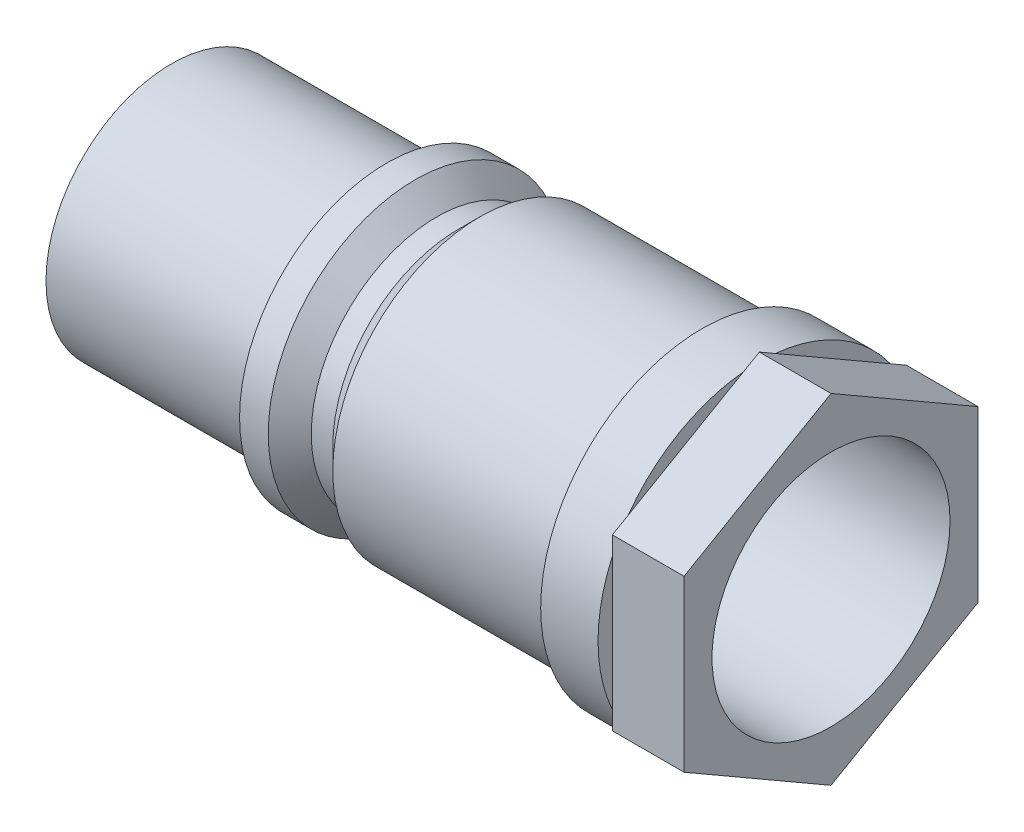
ISO-10303-21;
HEADER;
FILE_DESCRIPTION(('STEP AP214'),'2;1');
FILE_NAME('part.step','',(''),(''),'','','');
FILE_SCHEMA(('AUTOMOTIVE_DESIGN { 1 0 10303 214 1 1 1 1 }'));
ENDSEC;
DATA;
#1=APPLICATION_CONTEXT('core data for automotive mechanical design processes');
#2=APPLICATION_PROTOCOL_DEFINITION('international standard','automotive_design',2000,#1);
#3=PRODUCT_CONTEXT('',#1,'mechanical');
#4=PRODUCT('Part','Part','',(#3));
#5=PRODUCT_RELATED_PRODUCT_CATEGORY('part','',(#4));
#6=PRODUCT_DEFINITION_FORMATION('','',#4);
#7=PRODUCT_DEFINITION_CONTEXT('part definition',#1,'design');
#8=PRODUCT_DEFINITION('design','',#6,#7);
#9=PRODUCT_DEFINITION_SHAPE('','',#8);
#10=(LENGTH_UNIT() NAMED_UNIT(*) SI_UNIT(.MILLI.,.METRE.));
#11=(NAMED_UNIT(*) PLANE_ANGLE_UNIT() SI_UNIT($,.RADIAN.));
#12=(NAMED_UNIT(*) SI_UNIT($,.STERADIAN.) SOLID_ANGLE_UNIT());
#13=UNCERTAINTY_MEASURE_WITH_UNIT(LENGTH_MEASURE(1.E-05),#10,'distance_accuracy_value','');
#14=(GEOMETRIC_REPRESENTATION_CONTEXT(3) GLOBAL_UNCERTAINTY_ASSIGNED_CONTEXT((#13)) GLOBAL_UNIT_ASSIGNED_CONTEXT((#10,
#11,#12)) REPRESENTATION_CONTEXT('',''));
#15=CARTESIAN_POINT('',(0.,0.,0.));
#16=DIRECTION('',(0.,0.,1.));
#17=DIRECTION('',(1.,0.,0.));
#18=AXIS2_PLACEMENT_3D('',#15,#16,#17);
#19=CARTESIAN_POINT('',(82.,22.5,0.));
#20=DIRECTION('',(-1.,0.,0.));
#21=DIRECTION('',(0.,0.,1.));
#22=AXIS2_PLACEMENT_3D('',#19,#20,#21);
#23=PLANE('',#22);
#24=DIRECTION('',(0.,0.5,0.866025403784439));
#25=VECTOR('',#24,1.);
#26=CARTESIAN_POINT('',(82.,11.8356805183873,-20.5));
#27=LINE('',#26,#25);
#28=CARTESIAN_POINT('',(82.,13.1167115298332,-18.2811892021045));
#29=VERTEX_POINT('',#28);
#30=CARTESIAN_POINT('',(82.,22.3903300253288,-2.21881079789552));
#31=VERTEX_POINT('',#30);
#32=EDGE_CURVE('E11',#29,#31,#27,.T.);
#33=ORIENTED_EDGE('',*,*,#32,.F.);
#34=CARTESIAN_POINT('',(82.,0.,0.));
#35=DIRECTION('',(-1.,0.,0.));
#36=DIRECTION('',(0.,0.,1.));
#37=AXIS2_PLACEMENT_3D('',#34,#35,#36);
#38=CIRCLE('',#37,22.5);
#39=EDGE_CURVE('E269',#31,#29,#38,.T.);
#40=ORIENTED_EDGE('',*,*,#39,.F.);
#41=EDGE_LOOP('',(#33,#40));
#42=FACE_BOUND('',#41,.T.);
#43=ADVANCED_FACE('F33',(#42),#23,.F.);
#44=DIRECTION('',(0.,1.,0.));
#45=VECTOR('',#44,1.);
#46=CARTESIAN_POINT('',(82.,-11.8356805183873,-20.5));
#47=LINE('',#46,#45);
#48=CARTESIAN_POINT('',(82.,-9.2736184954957,-20.5));
#49=VERTEX_POINT('',#48);
#50=CARTESIAN_POINT('',(82.,9.27361849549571,-20.5));
#51=VERTEX_POINT('',#50);
#52=EDGE_CURVE('E42',#49,#51,#47,.T.);
#53=ORIENTED_EDGE('',*,*,#52,.F.);
#54=EDGE_CURVE('E273',#51,#49,#38,.T.);
#55=ORIENTED_EDGE('',*,*,#54,.F.);
#56=EDGE_LOOP('',(#53,#55));
#57=FACE_BOUND('',#56,.T.);
#58=ADVANCED_FACE('F238',(#57),#23,.F.);
#59=DIRECTION('',(0.,0.5,-0.866025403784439));
#60=VECTOR('',#59,1.);
#61=CARTESIAN_POINT('',(82.,-23.6713610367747,0.));
#62=LINE('',#61,#60);
#63=CARTESIAN_POINT('',(82.,-22.3903300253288,-2.21881079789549));
#64=VERTEX_POINT('',#63);
#65=CARTESIAN_POINT('',(82.,-13.1167115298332,-18.2811892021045));
#66=VERTEX_POINT('',#65);
#67=EDGE_CURVE('E307',#64,#66,#62,.T.);
#68=ORIENTED_EDGE('',*,*,#67,.F.);
#69=EDGE_CURVE('E279',#66,#64,#38,.T.);
#70=ORIENTED_EDGE('',*,*,#69,.F.);
#71=EDGE_LOOP('',(#68,#70));
#72=FACE_BOUND('',#71,.T.);
#73=ADVANCED_FACE('F245',(#72),#23,.F.);
#74=DIRECTION('',(0.,-0.5,-0.866025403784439));
#75=VECTOR('',#74,1.);
#76=CARTESIAN_POINT('',(82.,-11.8356805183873,20.5));
#77=LINE('',#76,#75);
#78=CARTESIAN_POINT('',(82.,-13.1167115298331,18.2811892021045));
#79=VERTEX_POINT('',#78);
#80=CARTESIAN_POINT('',(82.,-22.3903300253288,2.21881079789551));
#81=VERTEX_POINT('',#80);
#82=EDGE_CURVE('E58',#79,#81,#77,.T.);
#83=ORIENTED_EDGE('',*,*,#82,.F.);
#84=EDGE_CURVE('E285',#81,#79,#38,.T.);
#85=ORIENTED_EDGE('',*,*,#84,.F.);
#86=EDGE_LOOP('',(#83,#85));
#87=FACE_BOUND('',#86,.T.);
#88=ADVANCED_FACE('F257',(#87),#23,.F.);
#89=DIRECTION('',(0.,-1.,0.));
#90=VECTOR('',#89,1.);
#91=CARTESIAN_POINT('',(82.,11.8356805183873,20.5));
#92=LINE('',#91,#90);
#93=CARTESIAN_POINT('',(82.,9.27361849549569,20.5));
#94=VERTEX_POINT('',#93);
#95=CARTESIAN_POINT('',(82.,-9.27361849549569,20.5));
#96=VERTEX_POINT('',#95);
#97=EDGE_CURVE('E190',#94,#96,#92,.T.);
#98=ORIENTED_EDGE('',*,*,#97,.F.);
#99=EDGE_CURVE('E51',#96,#94,#38,.T.);
#100=ORIENTED_EDGE('',*,*,#99,.F.);
#101=EDGE_LOOP('',(#98,#100));
#102=FACE_BOUND('',#101,.T.);
#103=ADVANCED_FACE('F250',(#102),#23,.F.);
#104=DIRECTION('',(0.,-0.5,0.866025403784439));
#105=VECTOR('',#104,1.);
#106=CARTESIAN_POINT('',(82.,23.6713610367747,0.));
#107=LINE('',#106,#105);
#108=CARTESIAN_POINT('',(82.,22.3903300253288,2.21881079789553));
#109=VERTEX_POINT('',#108);
#110=CARTESIAN_POINT('',(82.,13.1167115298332,18.2811892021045));
#111=VERTEX_POINT('',#110);
#112=EDGE_CURVE('E186',#109,#111,#107,.T.);
#113=ORIENTED_EDGE('',*,*,#112,.F.);
#114=EDGE_CURVE('E161',#111,#109,#38,.T.);
#115=ORIENTED_EDGE('',*,*,#114,.F.);
#116=EDGE_LOOP('',(#113,#115));
#117=FACE_BOUND('',#116,.T.);
#118=ADVANCED_FACE('F241',(#117),#23,.F.);
#119=CARTESIAN_POINT('',(0.,0.,0.));
#120=DIRECTION('',(1.,0.,0.));
#121=DIRECTION('',(0.,0.,-1.));
#122=AXIS2_PLACEMENT_3D('',#119,#120,#121);
#123=PLANE('',#122);
#124=CARTESIAN_POINT('',(0.,0.,0.));
#125=DIRECTION('',(1.,0.,0.));
#126=DIRECTION('',(0.,0.,-1.));
#127=AXIS2_PLACEMENT_3D('',#124,#125,#126);
#128=CIRCLE('',#127,16.6);
#129=CARTESIAN_POINT('',(0.,0.,-16.6));
#130=VERTEX_POINT('',#129);
#131=EDGE_CURVE('E200',#130,#130,#128,.T.);
#132=ORIENTED_EDGE('',*,*,#131,.T.);
#133=EDGE_LOOP('',(#132));
#134=FACE_BOUND('',#133,.T.);
#135=CARTESIAN_POINT('',(0.,0.,0.));
#136=DIRECTION('',(-1.,0.,0.));
#137=DIRECTION('',(0.,0.,1.));
#138=AXIS2_PLACEMENT_3D('',#135,#136,#137);
#139=CIRCLE('',#138,17.5);
#140=CARTESIAN_POINT('',(0.,0.,17.5));
#141=VERTEX_POINT('',#140);
#142=EDGE_CURVE('E37',#141,#141,#139,.T.);
#143=ORIENTED_EDGE('',*,*,#142,.T.);
#144=EDGE_LOOP('',(#143));
#145=FACE_BOUND('',#144,.T.);
#146=ADVANCED_FACE('F35',(#134,#145),#123,.F.);
#147=CARTESIAN_POINT('',(0.,0.,0.));
#148=DIRECTION('',(-1.,0.,0.));
#149=DIRECTION('',(0.,0.,1.));
#150=AXIS2_PLACEMENT_3D('',#147,#148,#149);
#151=CYLINDRICAL_SURFACE('',#150,17.5);
#152=ORIENTED_EDGE('',*,*,#142,.F.);
#153=EDGE_LOOP('',(#152));
#154=FACE_BOUND('',#153,.T.);
#155=CARTESIAN_POINT('',(30.,0.,0.));
#156=DIRECTION('',(-1.,0.,0.));
#157=DIRECTION('',(0.,0.,1.));
#158=AXIS2_PLACEMENT_3D('',#155,#156,#157);
#159=CIRCLE('',#158,17.5);
#160=CARTESIAN_POINT('',(30.,0.,17.5));
#161=VERTEX_POINT('',#160);
#162=EDGE_CURVE('E181',#161,#161,#159,.T.);
#163=ORIENTED_EDGE('',*,*,#162,.T.);
#164=EDGE_LOOP('',(#163));
#165=FACE_BOUND('',#164,.T.);
#166=ADVANCED_FACE('F256',(#154,#165),#151,.T.);
#167=CARTESIAN_POINT('',(30.,17.5,0.));
#168=DIRECTION('',(1.,0.,0.));
#169=DIRECTION('',(0.,0.,-1.));
#170=AXIS2_PLACEMENT_3D('',#167,#168,#169);
#171=PLANE('',#170);
#172=ORIENTED_EDGE('',*,*,#162,.F.);
#173=EDGE_LOOP('',(#172));
#174=FACE_BOUND('',#173,.T.);
#175=CARTESIAN_POINT('',(30.,0.,0.));
#176=DIRECTION('',(-1.,0.,0.));
#177=DIRECTION('',(0.,0.,1.));
#178=AXIS2_PLACEMENT_3D('',#175,#176,#177);
#179=CIRCLE('',#178,20.5);
#180=CARTESIAN_POINT('',(30.,0.,20.5));
#181=VERTEX_POINT('',#180);
#182=EDGE_CURVE('E179',#181,#181,#179,.T.);
#183=ORIENTED_EDGE('',*,*,#182,.T.);
#184=EDGE_LOOP('',(#183));
#185=FACE_BOUND('',#184,.T.);
#186=ADVANCED_FACE('F470',(#174,#185),#171,.F.);
#187=CARTESIAN_POINT('',(0.,0.,0.));
#188=DIRECTION('',(-1.,0.,0.));
#189=DIRECTION('',(0.,0.,1.));
#190=AXIS2_PLACEMENT_3D('',#187,#188,#189);
#191=CYLINDRICAL_SURFACE('',#190,20.5);
#192=ORIENTED_EDGE('',*,*,#182,.F.);
#193=EDGE_LOOP('',(#192));
#194=FACE_BOUND('',#193,.T.);
#195=CARTESIAN_POINT('',(34.,0.,0.));
#196=DIRECTION('',(-1.,0.,0.));
#197=DIRECTION('',(0.,0.,1.));
#198=AXIS2_PLACEMENT_3D('',#195,#196,#197);
#199=CIRCLE('',#198,20.5);
#200=CARTESIAN_POINT('',(34.,0.,20.5));
#201=VERTEX_POINT('',#200);
#202=EDGE_CURVE('E176',#201,#201,#199,.T.);
#203=ORIENTED_EDGE('',*,*,#202,.T.);
#204=EDGE_LOOP('',(#203));
#205=FACE_BOUND('',#204,.T.);
#206=ADVANCED_FACE('F476',(#194,#205),#191,.T.);
#207=CARTESIAN_POINT('',(37.,0.,0.));
#208=DIRECTION('',(-1.,0.,0.));
#209=DIRECTION('',(0.,0.,1.));
#210=AXIS2_PLACEMENT_3D('',#207,#208,#209);
#211=CONICAL_SURFACE('',#210,17.5,0.78539816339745);
#212=ORIENTED_EDGE('',*,*,#202,.F.);
#213=EDGE_LOOP('',(#212));
#214=FACE_BOUND('',#213,.T.);
#215=CARTESIAN_POINT('',(37.,0.,0.));
#216=DIRECTION('',(-1.,0.,0.));
#217=DIRECTION('',(0.,0.,1.));
#218=AXIS2_PLACEMENT_3D('',#215,#216,#217);
#219=CIRCLE('',#218,17.5);
#220=CARTESIAN_POINT('',(37.,0.,17.5));
#221=VERTEX_POINT('',#220);
#222=EDGE_CURVE('E173',#221,#221,#219,.T.);
#223=ORIENTED_EDGE('',*,*,#222,.T.);
#224=EDGE_LOOP('',(#223));
#225=FACE_BOUND('',#224,.T.);
#226=ADVANCED_FACE('F484',(#214,#225),#211,.T.);
#227=CARTESIAN_POINT('',(0.,0.,0.));
#228=DIRECTION('',(-1.,0.,0.));
#229=DIRECTION('',(0.,0.,1.));
#230=AXIS2_PLACEMENT_3D('',#227,#228,#229);
#231=CYLINDRICAL_SURFACE('',#230,17.5);
#232=ORIENTED_EDGE('',*,*,#222,.F.);
#233=EDGE_LOOP('',(#232));
#234=FACE_BOUND('',#233,.T.);
#235=CARTESIAN_POINT('',(40.,0.,0.));
#236=DIRECTION('',(-1.,0.,0.));
#237=DIRECTION('',(0.,0.,1.));
#238=AXIS2_PLACEMENT_3D('',#235,#236,#237);
#239=CIRCLE('',#238,17.5);
#240=CARTESIAN_POINT('',(40.,0.,17.5));
#241=VERTEX_POINT('',#240);
#242=EDGE_CURVE('E170',#241,#241,#239,.T.);
#243=ORIENTED_EDGE('',*,*,#242,.T.);
#244=EDGE_LOOP('',(#243));
#245=FACE_BOUND('',#244,.T.);
#246=ADVANCED_FACE('F492',(#234,#245),#231,.T.);
#247=CARTESIAN_POINT('',(43.,0.,0.));
#248=DIRECTION('',(1.,0.,0.));
#249=DIRECTION('',(0.,0.,-1.));
#250=AXIS2_PLACEMENT_3D('',#247,#248,#249);
#251=CONICAL_SURFACE('',#250,20.5,0.785398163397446);
#252=ORIENTED_EDGE('',*,*,#242,.F.);
#253=EDGE_LOOP('',(#252));
#254=FACE_BOUND('',#253,.T.);
#255=CARTESIAN_POINT('',(43.,0.,0.));
#256=DIRECTION('',(-1.,0.,0.));
#257=DIRECTION('',(0.,0.,1.));
#258=AXIS2_PLACEMENT_3D('',#255,#256,#257);
#259=CIRCLE('',#258,20.5);
#260=CARTESIAN_POINT('',(43.,0.,20.5));
#261=VERTEX_POINT('',#260);
#262=EDGE_CURVE('E167',#261,#261,#259,.T.);
#263=ORIENTED_EDGE('',*,*,#262,.T.);
#264=EDGE_LOOP('',(#263));
#265=FACE_BOUND('',#264,.T.);
#266=ADVANCED_FACE('F500',(#254,#265),#251,.T.);
#267=CARTESIAN_POINT('',(0.,0.,0.));
#268=DIRECTION('',(-1.,0.,0.));
#269=DIRECTION('',(0.,0.,1.));
#270=AXIS2_PLACEMENT_3D('',#267,#268,#269);
#271=CYLINDRICAL_SURFACE('',#270,20.5);
#272=ORIENTED_EDGE('',*,*,#262,.F.);
#273=EDGE_LOOP('',(#272));
#274=FACE_BOUND('',#273,.T.);
#275=CARTESIAN_POINT('',(74.,0.,0.));
#276=DIRECTION('',(-1.,0.,0.));
#277=DIRECTION('',(0.,0.,1.));
#278=AXIS2_PLACEMENT_3D('',#275,#276,#277);
#279=CIRCLE('',#278,20.5);
#280=CARTESIAN_POINT('',(74.,0.,20.5));
#281=VERTEX_POINT('',#280);
#282=EDGE_CURVE('E164',#281,#281,#279,.T.);
#283=ORIENTED_EDGE('',*,*,#282,.T.);
#284=EDGE_LOOP('',(#283));
#285=FACE_BOUND('',#284,.T.);
#286=ADVANCED_FACE('F508',(#274,#285),#271,.T.);
#287=CARTESIAN_POINT('',(74.,20.5,0.));
#288=DIRECTION('',(1.,0.,0.));
#289=DIRECTION('',(0.,0.,-1.));
#290=AXIS2_PLACEMENT_3D('',#287,#288,#289);
#291=PLANE('',#290);
#292=ORIENTED_EDGE('',*,*,#282,.F.);
#293=EDGE_LOOP('',(#292));
#294=FACE_BOUND('',#293,.T.);
#295=CARTESIAN_POINT('',(74.,0.,0.));
#296=DIRECTION('',(-1.,0.,0.));
#297=DIRECTION('',(0.,0.,1.));
#298=AXIS2_PLACEMENT_3D('',#295,#296,#297);
#299=CIRCLE('',#298,22.5);
#300=CARTESIAN_POINT('',(74.,0.,22.5));
#301=VERTEX_POINT('',#300);
#302=EDGE_CURVE('E160',#301,#301,#299,.T.);
#303=ORIENTED_EDGE('',*,*,#302,.T.);
#304=EDGE_LOOP('',(#303));
#305=FACE_BOUND('',#304,.T.);
#306=ADVANCED_FACE('F353',(#294,#305),#291,.F.);
#307=CARTESIAN_POINT('',(0.,0.,0.));
#308=DIRECTION('',(-1.,0.,0.));
#309=DIRECTION('',(0.,0.,1.));
#310=AXIS2_PLACEMENT_3D('',#307,#308,#309);
#311=CYLINDRICAL_SURFACE('',#310,22.5);
#312=ORIENTED_EDGE('',*,*,#302,.F.);
#313=EDGE_LOOP('',(#312));
#314=FACE_BOUND('',#313,.T.);
#315=EDGE_CURVE('E155',#94,#111,#38,.T.);
#316=ORIENTED_EDGE('',*,*,#315,.T.);
#317=ORIENTED_EDGE('',*,*,#114,.T.);
#318=EDGE_CURVE('E265',#109,#31,#38,.T.);
#319=ORIENTED_EDGE('',*,*,#318,.T.);
#320=ORIENTED_EDGE('',*,*,#39,.T.);
#321=EDGE_CURVE('E270',#29,#51,#38,.T.);
#322=ORIENTED_EDGE('',*,*,#321,.T.);
#323=ORIENTED_EDGE('',*,*,#54,.T.);
#324=EDGE_CURVE('E276',#49,#66,#38,.T.);
#325=ORIENTED_EDGE('',*,*,#324,.T.);
#326=ORIENTED_EDGE('',*,*,#69,.T.);
#327=EDGE_CURVE('E282',#64,#81,#38,.T.);
#328=ORIENTED_EDGE('',*,*,#327,.T.);
#329=ORIENTED_EDGE('',*,*,#84,.T.);
#330=EDGE_CURVE('E153',#79,#96,#38,.T.);
#331=ORIENTED_EDGE('',*,*,#330,.T.);
#332=ORIENTED_EDGE('',*,*,#99,.T.);
#333=EDGE_LOOP('',(#316,#317,#319,#320,#322,#323,#325,#326,#328,#329,#331,#332));
#334=FACE_BOUND('',#333,.T.);
#335=ADVANCED_FACE('F263',(#314,#334),#311,.T.);
#336=CARTESIAN_POINT('',(82.,0.,0.));
#337=DIRECTION('',(1.,0.,0.));
#338=DIRECTION('',(0.,0.,-1.));
#339=AXIS2_PLACEMENT_3D('',#336,#337,#338);
#340=PLANE('',#339);
#341=ORIENTED_EDGE('',*,*,#315,.F.);
#342=CARTESIAN_POINT('',(82.,11.8356805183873,20.5));
#343=VERTEX_POINT('',#342);
#344=EDGE_CURVE('E196',#343,#94,#92,.T.);
#345=ORIENTED_EDGE('',*,*,#344,.F.);
#346=EDGE_CURVE('E193',#111,#343,#107,.T.);
#347=ORIENTED_EDGE('',*,*,#346,.F.);
#348=EDGE_LOOP('',(#341,#345,#347));
#349=FACE_BOUND('',#348,.T.);
#350=ADVANCED_FACE('F232',(#349),#340,.F.);
#351=ORIENTED_EDGE('',*,*,#318,.F.);
#352=CARTESIAN_POINT('',(82.,23.6713610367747,0.));
#353=VERTEX_POINT('',#352);
#354=EDGE_CURVE('E192',#353,#109,#107,.T.);
#355=ORIENTED_EDGE('',*,*,#354,.F.);
#356=EDGE_CURVE('E45',#31,#353,#27,.T.);
#357=ORIENTED_EDGE('',*,*,#356,.F.);
#358=EDGE_LOOP('',(#351,#355,#357));
#359=FACE_BOUND('',#358,.T.);
#360=ADVANCED_FACE('F268',(#359),#340,.F.);
#361=ORIENTED_EDGE('',*,*,#321,.F.);
#362=CARTESIAN_POINT('',(82.,11.8356805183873,-20.5));
#363=VERTEX_POINT('',#362);
#364=EDGE_CURVE('E44',#363,#29,#27,.T.);
#365=ORIENTED_EDGE('',*,*,#364,.F.);
#366=EDGE_CURVE('E306',#51,#363,#47,.T.);
#367=ORIENTED_EDGE('',*,*,#366,.F.);
#368=EDGE_LOOP('',(#361,#365,#367));
#369=FACE_BOUND('',#368,.T.);
#370=ADVANCED_FACE('F328',(#369),#340,.F.);
#371=ORIENTED_EDGE('',*,*,#324,.F.);
#372=CARTESIAN_POINT('',(82.,-11.8356805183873,-20.5));
#373=VERTEX_POINT('',#372);
#374=EDGE_CURVE('E146',#373,#49,#47,.T.);
#375=ORIENTED_EDGE('',*,*,#374,.F.);
#376=EDGE_CURVE('E302',#66,#373,#62,.T.);
#377=ORIENTED_EDGE('',*,*,#376,.F.);
#378=EDGE_LOOP('',(#371,#375,#377));
#379=FACE_BOUND('',#378,.T.);
#380=ADVANCED_FACE('F379',(#379),#340,.F.);
#381=ORIENTED_EDGE('',*,*,#327,.F.);
#382=CARTESIAN_POINT('',(82.,-23.6713610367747,0.));
#383=VERTEX_POINT('',#382);
#384=EDGE_CURVE('E303',#383,#64,#62,.T.);
#385=ORIENTED_EDGE('',*,*,#384,.F.);
#386=EDGE_CURVE('E299',#81,#383,#77,.T.);
#387=ORIENTED_EDGE('',*,*,#386,.F.);
#388=EDGE_LOOP('',(#381,#385,#387));
#389=FACE_BOUND('',#388,.T.);
#390=ADVANCED_FACE('F233',(#389),#340,.F.);
#391=CARTESIAN_POINT('',(92.,11.8356805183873,-20.5));
#392=DIRECTION('',(0.,-0.866025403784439,0.5));
#393=DIRECTION('',(0.,-0.5,-0.866025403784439));
#394=AXIS2_PLACEMENT_3D('',#391,#392,#393);
#395=PLANE('',#394);
#396=ORIENTED_EDGE('',*,*,#364,.T.);
#397=ORIENTED_EDGE('',*,*,#32,.T.);
#398=ORIENTED_EDGE('',*,*,#356,.T.);
#399=DIRECTION('',(-1.,0.,0.));
#400=VECTOR('',#399,1.);
#401=CARTESIAN_POINT('',(92.,23.6713610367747,0.));
#402=LINE('',#401,#400);
#403=CARTESIAN_POINT('',(92.,23.6713610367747,0.));
#404=VERTEX_POINT('',#403);
#405=EDGE_CURVE('E131',#404,#353,#402,.T.);
#406=ORIENTED_EDGE('',*,*,#405,.F.);
#407=DIRECTION('',(0.,0.5,0.866025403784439));
#408=VECTOR('',#407,1.);
#409=CARTESIAN_POINT('',(92.,11.8356805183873,-20.5));
#410=LINE('',#409,#408);
#411=CARTESIAN_POINT('',(92.,11.8356805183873,-20.5));
#412=VERTEX_POINT('',#411);
#413=EDGE_CURVE('E137',#412,#404,#410,.T.);
#414=ORIENTED_EDGE('',*,*,#413,.F.);
#415=DIRECTION('',(-1.,0.,0.));
#416=VECTOR('',#415,1.);
#417=CARTESIAN_POINT('',(92.,11.8356805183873,-20.5));
#418=LINE('',#417,#416);
#419=EDGE_CURVE('E203',#412,#363,#418,.T.);
#420=ORIENTED_EDGE('',*,*,#419,.T.);
#421=EDGE_LOOP('',(#396,#397,#398,#406,#414,#420));
#422=FACE_BOUND('',#421,.T.);
#423=ADVANCED_FACE('F149',(#422),#395,.F.);
#424=CARTESIAN_POINT('',(92.,23.6713610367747,0.));
#425=DIRECTION('',(0.,-0.866025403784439,-0.5));
#426=DIRECTION('',(0.,0.5,-0.866025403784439));
#427=AXIS2_PLACEMENT_3D('',#424,#425,#426);
#428=PLANE('',#427);
#429=ORIENTED_EDGE('',*,*,#354,.T.);
#430=ORIENTED_EDGE('',*,*,#112,.T.);
#431=ORIENTED_EDGE('',*,*,#346,.T.);
#432=DIRECTION('',(-1.,0.,0.));
#433=VECTOR('',#432,1.);
#434=CARTESIAN_POINT('',(92.,11.8356805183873,20.5));
#435=LINE('',#434,#433);
#436=CARTESIAN_POINT('',(92.,11.8356805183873,20.5));
#437=VERTEX_POINT('',#436);
#438=EDGE_CURVE('E133',#437,#343,#435,.T.);
#439=ORIENTED_EDGE('',*,*,#438,.F.);
#440=DIRECTION('',(0.,-0.5,0.866025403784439));
#441=VECTOR('',#440,1.);
#442=CARTESIAN_POINT('',(92.,23.6713610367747,0.));
#443=LINE('',#442,#441);
#444=EDGE_CURVE('E126',#404,#437,#443,.T.);
#445=ORIENTED_EDGE('',*,*,#444,.F.);
#446=ORIENTED_EDGE('',*,*,#405,.T.);
#447=EDGE_LOOP('',(#429,#430,#431,#439,#445,#446));
#448=FACE_BOUND('',#447,.T.);
#449=ADVANCED_FACE('F129',(#448),#428,.F.);
#450=CARTESIAN_POINT('',(92.,11.8356805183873,20.5));
#451=DIRECTION('',(0.,0.,-1.));
#452=DIRECTION('',(-1.,0.,0.));
#453=AXIS2_PLACEMENT_3D('',#450,#451,#452);
#454=PLANE('',#453);
#455=ORIENTED_EDGE('',*,*,#344,.T.);
#456=ORIENTED_EDGE('',*,*,#97,.T.);
#457=CARTESIAN_POINT('',(82.,-11.8356805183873,20.5));
#458=VERTEX_POINT('',#457);
#459=EDGE_CURVE('E197',#96,#458,#92,.T.);
#460=ORIENTED_EDGE('',*,*,#459,.T.);
#461=DIRECTION('',(-1.,0.,0.));
#462=VECTOR('',#461,1.);
#463=CARTESIAN_POINT('',(92.,-11.8356805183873,20.5));
#464=LINE('',#463,#462);
#465=CARTESIAN_POINT('',(92.,-11.8356805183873,20.5));
#466=VERTEX_POINT('',#465);
#467=EDGE_CURVE('E156',#466,#458,#464,.T.);
#468=ORIENTED_EDGE('',*,*,#467,.F.);
#469=DIRECTION('',(0.,-1.,0.));
#470=VECTOR('',#469,1.);
#471=CARTESIAN_POINT('',(92.,11.8356805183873,20.5));
#472=LINE('',#471,#470);
#473=EDGE_CURVE('E136',#437,#466,#472,.T.);
#474=ORIENTED_EDGE('',*,*,#473,.F.);
#475=ORIENTED_EDGE('',*,*,#438,.T.);
#476=EDGE_LOOP('',(#455,#456,#460,#468,#474,#475));
#477=FACE_BOUND('',#476,.T.);
#478=ADVANCED_FACE('F296',(#477),#454,.F.);
#479=CARTESIAN_POINT('',(92.,-11.8356805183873,20.5));
#480=DIRECTION('',(0.,0.866025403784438,-0.5));
#481=DIRECTION('',(0.,0.5,0.866025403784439));
#482=AXIS2_PLACEMENT_3D('',#479,#480,#481);
#483=PLANE('',#482);
#484=EDGE_CURVE('E291',#458,#79,#77,.T.);
#485=ORIENTED_EDGE('',*,*,#484,.T.);
#486=ORIENTED_EDGE('',*,*,#82,.T.);
#487=ORIENTED_EDGE('',*,*,#386,.T.);
#488=DIRECTION('',(-1.,0.,0.));
#489=VECTOR('',#488,1.);
#490=CARTESIAN_POINT('',(92.,-23.6713610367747,0.));
#491=LINE('',#490,#489);
#492=CARTESIAN_POINT('',(92.,-23.6713610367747,0.));
#493=VERTEX_POINT('',#492);
#494=EDGE_CURVE('E314',#493,#383,#491,.T.);
#495=ORIENTED_EDGE('',*,*,#494,.F.);
#496=DIRECTION('',(0.,-0.5,-0.866025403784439));
#497=VECTOR('',#496,1.);
#498=CARTESIAN_POINT('',(92.,-11.8356805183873,20.5));
#499=LINE('',#498,#497);
#500=EDGE_CURVE('E206',#466,#493,#499,.T.);
#501=ORIENTED_EDGE('',*,*,#500,.F.);
#502=ORIENTED_EDGE('',*,*,#467,.T.);
#503=EDGE_LOOP('',(#485,#486,#487,#495,#501,#502));
#504=FACE_BOUND('',#503,.T.);
#505=ADVANCED_FACE('F318',(#504),#483,.F.);
#506=CARTESIAN_POINT('',(92.,-23.6713610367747,0.));
#507=DIRECTION('',(0.,0.866025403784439,0.5));
#508=DIRECTION('',(0.,-0.5,0.866025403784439));
#509=AXIS2_PLACEMENT_3D('',#506,#507,#508);
#510=PLANE('',#509);
#511=ORIENTED_EDGE('',*,*,#384,.T.);
#512=ORIENTED_EDGE('',*,*,#67,.T.);
#513=ORIENTED_EDGE('',*,*,#376,.T.);
#514=DIRECTION('',(-1.,0.,0.));
#515=VECTOR('',#514,1.);
#516=CARTESIAN_POINT('',(92.,-11.8356805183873,-20.5));
#517=LINE('',#516,#515);
#518=CARTESIAN_POINT('',(92.,-11.8356805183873,-20.5));
#519=VERTEX_POINT('',#518);
#520=EDGE_CURVE('E311',#519,#373,#517,.T.);
#521=ORIENTED_EDGE('',*,*,#520,.F.);
#522=DIRECTION('',(0.,0.5,-0.866025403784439));
#523=VECTOR('',#522,1.);
#524=CARTESIAN_POINT('',(92.,-23.6713610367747,0.));
#525=LINE('',#524,#523);
#526=EDGE_CURVE('E204',#493,#519,#525,.T.);
#527=ORIENTED_EDGE('',*,*,#526,.F.);
#528=ORIENTED_EDGE('',*,*,#494,.T.);
#529=EDGE_LOOP('',(#511,#512,#513,#521,#527,#528));
#530=FACE_BOUND('',#529,.T.);
#531=ADVANCED_FACE('F234',(#530),#510,.F.);
#532=CARTESIAN_POINT('',(92.,-11.8356805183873,-20.5));
#533=DIRECTION('',(0.,0.,1.));
#534=DIRECTION('',(0.,-1.,0.));
#535=AXIS2_PLACEMENT_3D('',#532,#533,#534);
#536=PLANE('',#535);
#537=ORIENTED_EDGE('',*,*,#374,.T.);
#538=ORIENTED_EDGE('',*,*,#52,.T.);
#539=ORIENTED_EDGE('',*,*,#366,.T.);
#540=ORIENTED_EDGE('',*,*,#419,.F.);
#541=DIRECTION('',(0.,1.,0.));
#542=VECTOR('',#541,1.);
#543=CARTESIAN_POINT('',(92.,-11.8356805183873,-20.5));
#544=LINE('',#543,#542);
#545=EDGE_CURVE('E142',#519,#412,#544,.T.);
#546=ORIENTED_EDGE('',*,*,#545,.F.);
#547=ORIENTED_EDGE('',*,*,#520,.T.);
#548=EDGE_LOOP('',(#537,#538,#539,#540,#546,#547));
#549=FACE_BOUND('',#548,.T.);
#550=ADVANCED_FACE('F224',(#549),#536,.F.);
#551=CARTESIAN_POINT('',(92.,0.,0.));
#552=DIRECTION('',(1.,0.,0.));
#553=DIRECTION('',(0.,0.,-1.));
#554=AXIS2_PLACEMENT_3D('',#551,#552,#553);
#555=PLANE('',#554);
#556=CARTESIAN_POINT('',(92.,0.,0.));
#557=DIRECTION('',(1.,0.,0.));
#558=DIRECTION('',(0.,0.,-1.));
#559=AXIS2_PLACEMENT_3D('',#556,#557,#558);
#560=CIRCLE('',#559,16.6);
#561=CARTESIAN_POINT('',(92.,0.,-16.6));
#562=VERTEX_POINT('',#561);
#563=EDGE_CURVE('E209',#562,#562,#560,.T.);
#564=ORIENTED_EDGE('',*,*,#563,.F.);
#565=EDGE_LOOP('',(#564));
#566=FACE_BOUND('',#565,.T.);
#567=ORIENTED_EDGE('',*,*,#413,.T.);
#568=ORIENTED_EDGE('',*,*,#444,.T.);
#569=ORIENTED_EDGE('',*,*,#473,.T.);
#570=ORIENTED_EDGE('',*,*,#500,.T.);
#571=ORIENTED_EDGE('',*,*,#526,.T.);
#572=ORIENTED_EDGE('',*,*,#545,.T.);
#573=EDGE_LOOP('',(#567,#568,#569,#570,#571,#572));
#574=FACE_BOUND('',#573,.T.);
#575=ADVANCED_FACE('F140',(#566,#574),#555,.T.);
#576=ORIENTED_EDGE('',*,*,#330,.F.);
#577=ORIENTED_EDGE('',*,*,#484,.F.);
#578=ORIENTED_EDGE('',*,*,#459,.F.);
#579=EDGE_LOOP('',(#576,#577,#578));
#580=FACE_BOUND('',#579,.T.);
#581=ADVANCED_FACE('F219',(#580),#340,.F.);
#582=CARTESIAN_POINT('',(0.,0.,0.));
#583=DIRECTION('',(1.,0.,0.));
#584=DIRECTION('',(0.,0.,-1.));
#585=AXIS2_PLACEMENT_3D('',#582,#583,#584);
#586=CYLINDRICAL_SURFACE('',#585,16.6);
#587=ORIENTED_EDGE('',*,*,#131,.F.);
#588=EDGE_LOOP('',(#587));
#589=FACE_BOUND('',#588,.T.);
#590=ORIENTED_EDGE('',*,*,#563,.T.);
#591=EDGE_LOOP('',(#590));
#592=FACE_BOUND('',#591,.T.);
#593=ADVANCED_FACE('F216',(#589,#592),#586,.F.);
#594=CLOSED_SHELL('',(#43,#58,#73,#88,#103,#118,#146,#166,#186,#206,#226,#246,#266,#286,#306,
#335,#350,#360,#370,#380,#390,#423,#449,#478,#505,#531,#550,#575,#581,#593));
#595=MANIFOLD_SOLID_BREP('B2',#594);
#596=ADVANCED_BREP_SHAPE_REPRESENTATION('',(#18,#595),#14);
#597=SHAPE_DEFINITION_REPRESENTATION(#9,#596);
ENDSEC;
END-ISO-10303-21;
